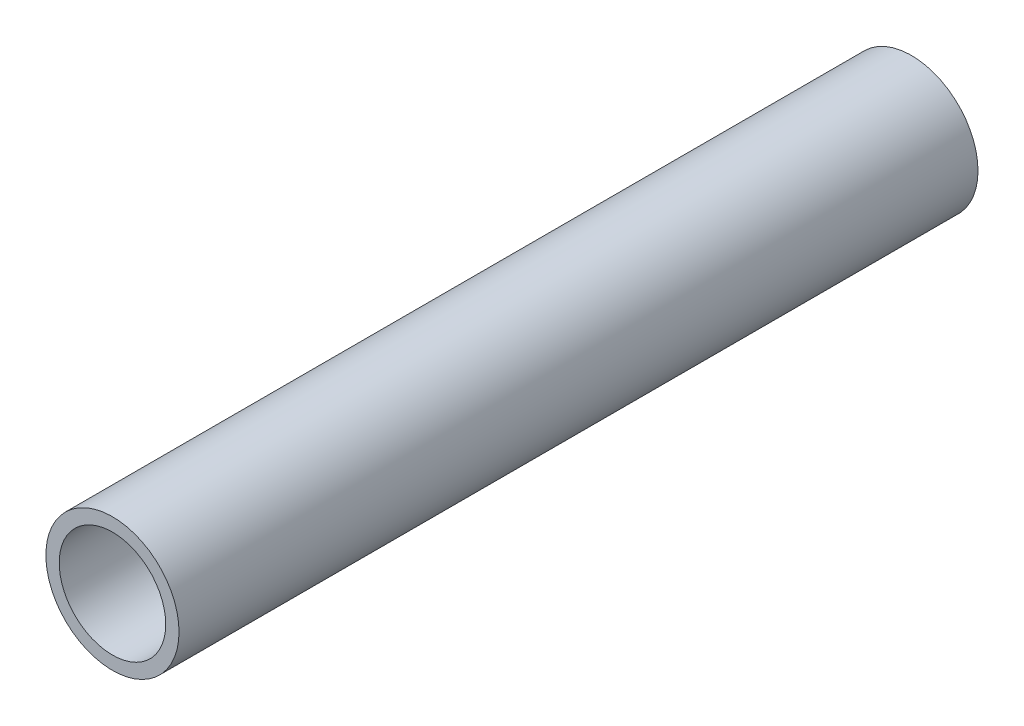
from build123d import *

# Parameters (mm, degrees)
SCHIZZO1_R                = 5
SCHIZZO1_R_2              = 4
ESTRUSIONE_SOTTILE1_DEPTH = 60


with BuildPart() as part:
    # Schizzo1 → Estrusione-Sottile1 (new body)
    with BuildSketch(Plane.XY):
        Circle(SCHIZZO1_R)
        Circle(SCHIZZO1_R_2, mode=Mode.SUBTRACT)
    extrude(amount=ESTRUSIONE_SOTTILE1_DEPTH)


solid = part.part
